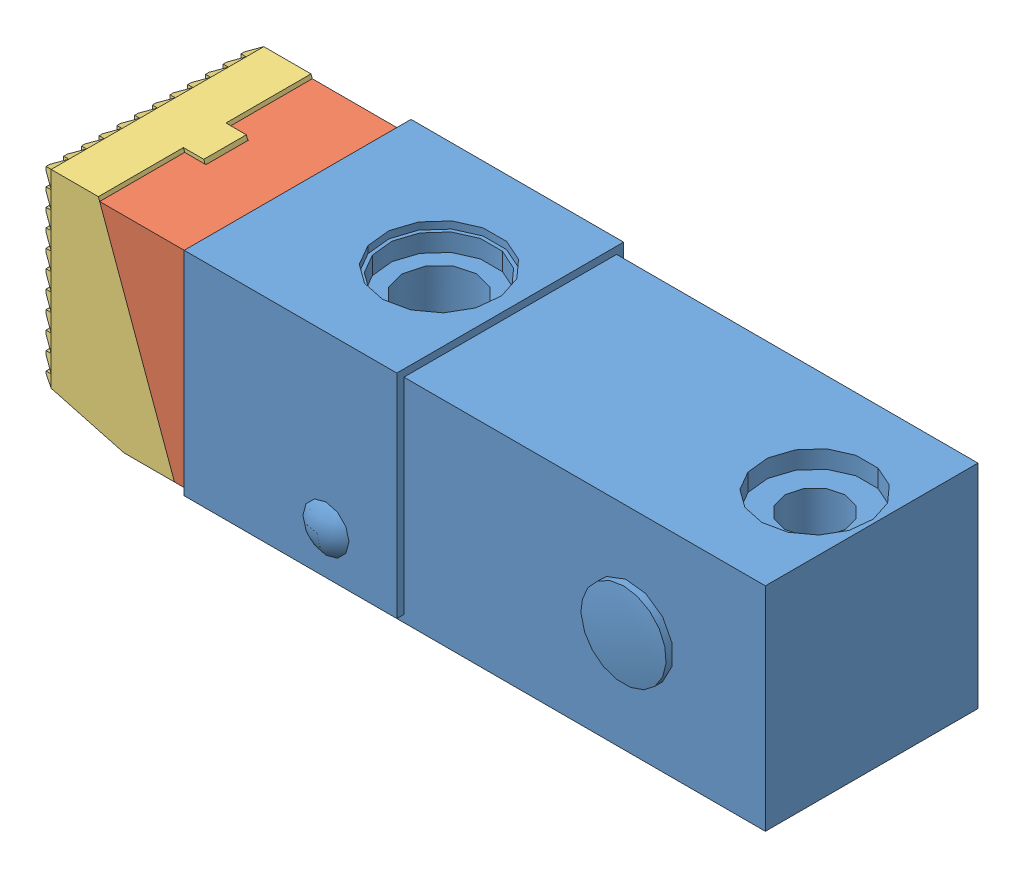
SolidWorks assembly ilcm41531105.SLDASM, configuration Default (file format 5000). Lengths in mm.
Overall size (102.5 31 34.4).
3 component instances, 3 part files, 5 mates.
Components (placement in the parent):
- ilcm41531105_body-1: ilcm41531105_body.sldprt [Default] at origin size (81 31 34.4)
- ilcm41531105_piston-1: ilcm41531105_piston.sldprt [Default] at (6.2076 1 0) size (57.5 29 30)
- ilcm41531105_jaw-1: ilcm41531105_jaw.sldprt [Default] at (-29.5 1 -15) size (22 29.5 30)
Mates (geometry in assembly coordinates):
- Distance1: distance = 0.5 mm aligned: plane of ilcm41531105_piston-1 through (-27.2924 30 15) normal (0 1 0); plane of ilcm41531105_jaw-1 through (-43.1104 30.5 15) normal (0 1 0)
- Symmetric1: symmetric aligned: plane of ilcm41531105_jaw-1 through (-51.5 1 15) normal (0 0 1); plane of ilcm41531105_jaw-1 through (-51.5 1 -15) normal (0 0 -1); plane of assembly through (0 0 0) normal (0 0 1)
- Coincident2: coincident anti-aligned: plane of ilcm41531105_piston-1 through (-42.9284 30 15) normal (-0.939693 -0.34202 0); plane of ilcm41531105_jaw-1 through (-32.3733 1 15) normal (0.939693 0.34202 0)
- Concentric1: concentric aligned: cylinder of ilcm41531105_body-1 through (35.2978 12.5 0) axis (-1 0 0) radius 9; cylinder of ilcm41531105_piston-1 through (6.2076 12.5 0) axis (-1 0 0) radius 9
- Distance2: distance = 102.5 mm anti-aligned: plane of ilcm41531105_body-1 through (51 31 15) normal (1 0 0); plane of ilcm41531105_jaw-1 through (-51.5 9.5 15) normal (-1 0 0)
